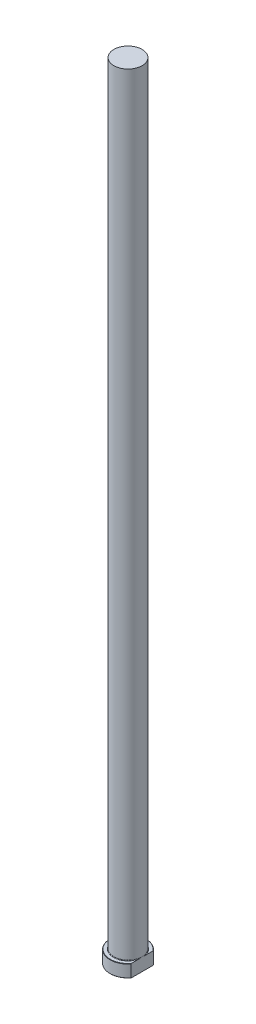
from build123d import *
from build123d.topology import SkipClean

# Parameters (mm, degrees)
CHAMFER1_SIZE    = 0.2
FILLET1_R        = 0.3
KEYED_HEAD_DEPTH = 501.264430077


with BuildPart() as part:
    # Sketch1 → Revolve1 (revolve)
    with BuildSketch(Plane.XY, mode=Mode.PRIVATE) as revolve1_sk:
        Polygon((0, 0), (-11.5, 0), (-11.5, 8), (-9, 8), (-9, 500), (0, 500), align=None)
    revolve(revolve1_sk.sketch.rotate(Axis((0, 259.958771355, 0), (0, -1, 0)), 270), axis=Axis((0, 259.958771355, 0), (0, -1, 0)))

    # Chamfer1
    chamfer1_edges = [part.edges().sort_by_distance(p)[0] for p in [
        (0, 8, -11.5),
        (0, 0, -11.5),
    ]]
    chamfer(chamfer1_edges, length=CHAMFER1_SIZE)

    # Fillet1
    fillet1_edges = [part.edges().sort_by_distance(p)[0] for p in [
        (0, 8, -9),
    ]]
    fillet(fillet1_edges, radius=FILLET1_R)

    # Sketch2 → KEYED HEAD (cut, through all)
    with SkipClean():  # the faces are left unmerged after this step: merging them gives an invalid solid
        with BuildSketch(Plane(origin=(0, 0, 0), x_dir=(1, 0, 0), z_dir=(0, 1, 0))):
            with BuildLine():
                Line((9, -7.158910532), (9, 7.158910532))
                ThreePointArc((9, 7.158910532), (11.5, 0), (9, -7.158910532))
            make_face()
        extrude(amount=KEYED_HEAD_DEPTH, mode=Mode.SUBTRACT)


solid = part.part
